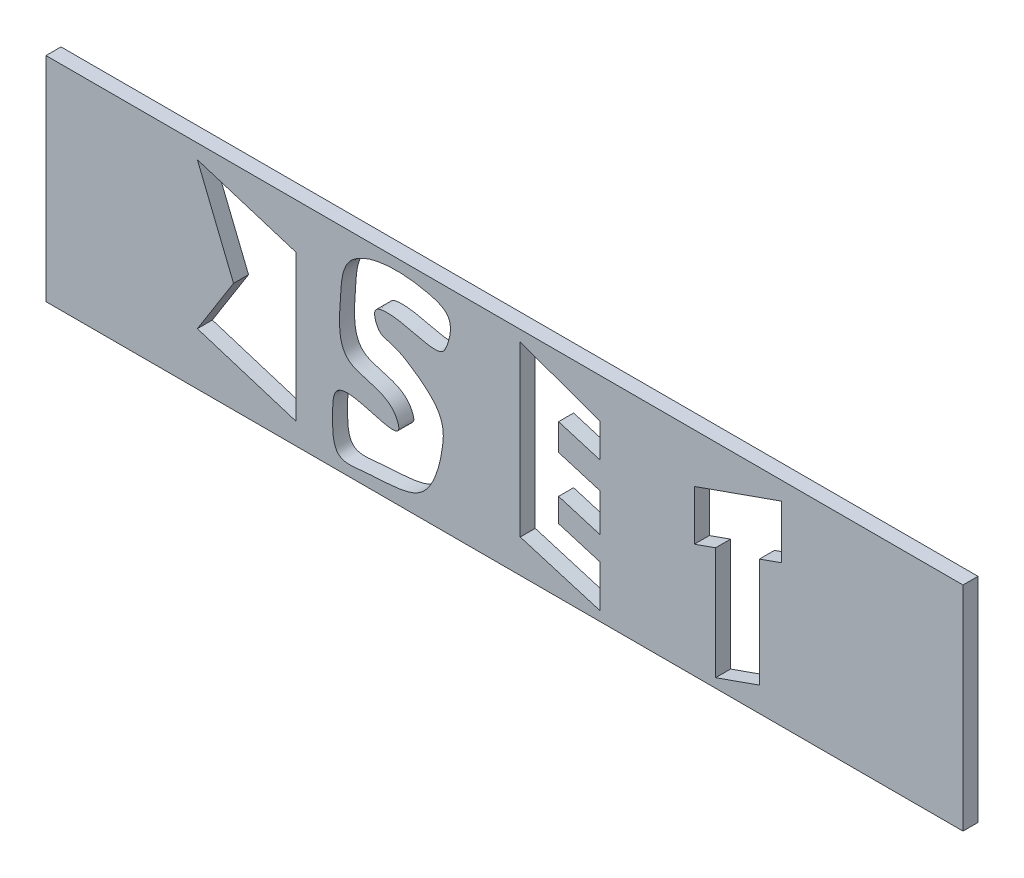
ISO-10303-21;
HEADER;
FILE_DESCRIPTION(('STEP AP214'),'2;1');
FILE_NAME('part.step','',(''),(''),'','','');
FILE_SCHEMA(('AUTOMOTIVE_DESIGN { 1 0 10303 214 1 1 1 1 }'));
ENDSEC;
DATA;
#1=APPLICATION_CONTEXT('core data for automotive mechanical design processes');
#2=APPLICATION_PROTOCOL_DEFINITION('international standard','automotive_design',2000,#1);
#3=PRODUCT_CONTEXT('',#1,'mechanical');
#4=PRODUCT('Part','Part','',(#3));
#5=PRODUCT_RELATED_PRODUCT_CATEGORY('part','',(#4));
#6=PRODUCT_DEFINITION_FORMATION('','',#4);
#7=PRODUCT_DEFINITION_CONTEXT('part definition',#1,'design');
#8=PRODUCT_DEFINITION('design','',#6,#7);
#9=PRODUCT_DEFINITION_SHAPE('','',#8);
#10=(LENGTH_UNIT() NAMED_UNIT(*) SI_UNIT(.MILLI.,.METRE.));
#11=(NAMED_UNIT(*) PLANE_ANGLE_UNIT() SI_UNIT($,.RADIAN.));
#12=(NAMED_UNIT(*) SI_UNIT($,.STERADIAN.) SOLID_ANGLE_UNIT());
#13=UNCERTAINTY_MEASURE_WITH_UNIT(LENGTH_MEASURE(1.E-05),#10,'distance_accuracy_value','');
#14=(GEOMETRIC_REPRESENTATION_CONTEXT(3) GLOBAL_UNCERTAINTY_ASSIGNED_CONTEXT((#13)) GLOBAL_UNIT_ASSIGNED_CONTEXT((#10,
#11,#12)) REPRESENTATION_CONTEXT('',''));
#15=CARTESIAN_POINT('',(0.,0.,0.));
#16=DIRECTION('',(0.,0.,1.));
#17=DIRECTION('',(1.,0.,0.));
#18=AXIS2_PLACEMENT_3D('',#15,#16,#17);
#19=CARTESIAN_POINT('',(0.,139.,9.));
#20=DIRECTION('',(0.,0.,-1.));
#21=DIRECTION('',(-1.,0.,0.));
#22=AXIS2_PLACEMENT_3D('',#19,#20,#21);
#23=PLANE('',#22);
#24=DIRECTION('',(0.,-1.,0.));
#25=VECTOR('',#24,1.);
#26=CARTESIAN_POINT('',(410.474193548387,71.5,9.));
#27=LINE('',#26,#25);
#28=CARTESIAN_POINT('',(410.474193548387,101.5,9.));
#29=VERTEX_POINT('',#28);
#30=CARTESIAN_POINT('',(410.474193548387,71.5,9.));
#31=VERTEX_POINT('',#30);
#32=EDGE_CURVE('E254',#29,#31,#27,.T.);
#33=ORIENTED_EDGE('',*,*,#32,.F.);
#34=DIRECTION('',(-0.942791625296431,-0.333382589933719,0.));
#35=VECTOR('',#34,1.);
#36=CARTESIAN_POINT('',(410.474193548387,101.5,9.));
#37=LINE('',#36,#35);
#38=CARTESIAN_POINT('',(462.791397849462,120.,9.));
#39=VERTEX_POINT('',#38);
#40=EDGE_CURVE('E270',#39,#29,#37,.T.);
#41=ORIENTED_EDGE('',*,*,#40,.F.);
#42=DIRECTION('',(0.,1.,0.));
#43=VECTOR('',#42,1.);
#44=CARTESIAN_POINT('',(462.791397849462,120.,9.));
#45=LINE('',#44,#43);
#46=CARTESIAN_POINT('',(462.791397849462,88.,9.));
#47=VERTEX_POINT('',#46);
#48=EDGE_CURVE('E267',#47,#39,#45,.T.);
#49=ORIENTED_EDGE('',*,*,#48,.F.);
#50=DIRECTION('',(0.942791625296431,0.333382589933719,0.));
#51=VECTOR('',#50,1.);
#52=CARTESIAN_POINT('',(462.791397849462,88.,9.));
#53=LINE('',#52,#51);
#54=CARTESIAN_POINT('',(449.5,83.3,9.));
#55=VERTEX_POINT('',#54);
#56=EDGE_CURVE('E265',#55,#47,#53,.T.);
#57=ORIENTED_EDGE('',*,*,#56,.F.);
#58=DIRECTION('',(0.,1.,0.));
#59=VECTOR('',#58,1.);
#60=CARTESIAN_POINT('',(449.5,83.3,9.));
#61=LINE('',#60,#59);
#62=CARTESIAN_POINT('',(449.5,17.8,9.));
#63=VERTEX_POINT('',#62);
#64=EDGE_CURVE('E263',#63,#55,#61,.T.);
#65=ORIENTED_EDGE('',*,*,#64,.F.);
#66=DIRECTION('',(0.942791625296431,0.333382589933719,0.));
#67=VECTOR('',#66,1.);
#68=CARTESIAN_POINT('',(449.5,17.8,9.));
#69=LINE('',#68,#67);
#70=CARTESIAN_POINT('',(423.2,8.5,9.));
#71=VERTEX_POINT('',#70);
#72=EDGE_CURVE('E261',#71,#63,#69,.T.);
#73=ORIENTED_EDGE('',*,*,#72,.F.);
#74=DIRECTION('',(0.,-1.,0.));
#75=VECTOR('',#74,1.);
#76=CARTESIAN_POINT('',(423.2,8.5,9.));
#77=LINE('',#76,#75);
#78=CARTESIAN_POINT('',(423.2,76.,9.));
#79=VERTEX_POINT('',#78);
#80=EDGE_CURVE('E259',#79,#71,#77,.T.);
#81=ORIENTED_EDGE('',*,*,#80,.F.);
#82=DIRECTION('',(0.942791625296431,0.33338258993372,0.));
#83=VECTOR('',#82,1.);
#84=CARTESIAN_POINT('',(423.2,76.,9.));
#85=LINE('',#84,#83);
#86=EDGE_CURVE('E256',#31,#79,#85,.T.);
#87=ORIENTED_EDGE('',*,*,#86,.F.);
#88=EDGE_LOOP('',(#33,#41,#49,#57,#65,#73,#81,#87));
#89=FACE_BOUND('',#88,.T.);
#90=CARTESIAN_POINT('',(250.451103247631,122.077203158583,9.));
#91=CARTESIAN_POINT('',(234.576066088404,125.766642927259,9.));
#92=CARTESIAN_POINT('',(209.832006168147,124.794224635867,9.));
#93=CARTESIAN_POINT('',(199.387770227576,110.754500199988,9.));
#94=CARTESIAN_POINT('',(197.001096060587,79.0117337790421,9.));
#95=CARTESIAN_POINT('',(195.444091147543,57.8599975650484,9.));
#96=CARTESIAN_POINT('',(227.725173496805,58.0916978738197,9.));
#97=CARTESIAN_POINT('',(238.712849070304,31.2573986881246,9.));
#98=CARTESIAN_POINT('',(193.842474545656,56.9884962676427,9.));
#99=CARTESIAN_POINT('',(193.249701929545,28.3580537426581,9.));
#100=CARTESIAN_POINT('',(193.414417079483,7.1790298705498,9.));
#101=CARTESIAN_POINT('',(221.156842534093,11.8813476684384,9.));
#102=CARTESIAN_POINT('',(250.675590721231,9.48355704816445,9.));
#103=CARTESIAN_POINT('',(262.105561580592,52.0392195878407,9.));
#104=CARTESIAN_POINT('',(259.8493853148,66.2444237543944,9.));
#105=CARTESIAN_POINT('',(227.651976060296,87.0164130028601,9.));
#106=CARTESIAN_POINT('',(221.79163942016,82.3551512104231,9.));
#107=CARTESIAN_POINT('',(217.05063217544,98.6346712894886,9.));
#108=CARTESIAN_POINT('',(236.826109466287,101.780458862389,9.));
#109=CARTESIAN_POINT('',(257.137510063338,89.9517733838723,9.));
#110=CARTESIAN_POINT('',(262.907018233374,102.013136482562,9.));
#111=CARTESIAN_POINT('',(267.671859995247,116.919735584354,9.));
#112=CARTESIAN_POINT('',(255.998863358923,120.787875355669,9.));
#113=CARTESIAN_POINT('',(250.451103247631,122.077203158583,9.));
#114=B_SPLINE_CURVE_WITH_KNOTS('',3,(#90,#91,#92,#93,#94,#95,#96,#97,#98,#99,#100,#101,#102,
#103,#104,#105,#106,#107,#108,#109,#110,#111,#112,#113),.UNSPECIFIED.,.T.,.F.,(4,1,2,1,1,1,1,1,
1,1,1,1,2,1,1,1,2,1,4),(0.,0.098400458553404,0.148759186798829,0.237266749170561,
0.301598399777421,0.317591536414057,0.401494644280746,0.435731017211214,0.482086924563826,
0.518804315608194,0.59904669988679,0.669356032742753,0.762623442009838,0.810518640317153,
0.828887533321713,0.845072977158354,0.92685254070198,0.965612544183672,1.),.UNSPECIFIED.);
#115=CARTESIAN_POINT('',(250.451103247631,122.077203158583,9.));
#116=VERTEX_POINT('',#115);
#117=EDGE_CURVE('E400',#116,#116,#114,.T.);
#118=ORIENTED_EDGE('',*,*,#117,.F.);
#119=EDGE_LOOP('',(#118));
#120=FACE_BOUND('',#119,.T.);
#121=DIRECTION('',(0.376679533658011,-0.9263436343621,0.));
#122=VECTOR('',#121,1.);
#123=CARTESIAN_POINT('',(134.,68.79,9.));
#124=LINE('',#123,#122);
#125=CARTESIAN_POINT('',(112.29,122.18,9.));
#126=VERTEX_POINT('',#125);
#127=CARTESIAN_POINT('',(134.,68.79,9.));
#128=VERTEX_POINT('',#127);
#129=EDGE_CURVE('E456',#126,#128,#124,.T.);
#130=ORIENTED_EDGE('',*,*,#129,.F.);
#131=DIRECTION('',(-0.954394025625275,0.298549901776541,0.));
#132=VECTOR('',#131,1.);
#133=CARTESIAN_POINT('',(112.29,122.18,9.));
#134=LINE('',#133,#132);
#135=CARTESIAN_POINT('',(171.59,103.63,9.));
#136=VERTEX_POINT('',#135);
#137=EDGE_CURVE('E787',#136,#126,#134,.T.);
#138=ORIENTED_EDGE('',*,*,#137,.F.);
#139=DIRECTION('',(0.,1.,0.));
#140=VECTOR('',#139,1.);
#141=CARTESIAN_POINT('',(171.59,103.63,9.));
#142=LINE('',#141,#140);
#143=CARTESIAN_POINT('',(171.59,15.82,9.));
#144=VERTEX_POINT('',#143);
#145=EDGE_CURVE('E803',#144,#136,#142,.T.);
#146=ORIENTED_EDGE('',*,*,#145,.F.);
#147=DIRECTION('',(0.954348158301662,-0.298696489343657,0.));
#148=VECTOR('',#147,1.);
#149=CARTESIAN_POINT('',(171.59,15.82,9.));
#150=LINE('',#149,#148);
#151=CARTESIAN_POINT('',(112.29,34.38,9.));
#152=VERTEX_POINT('',#151);
#153=EDGE_CURVE('E806',#152,#144,#150,.T.);
#154=ORIENTED_EDGE('',*,*,#153,.F.);
#155=DIRECTION('',(-0.533595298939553,-0.845739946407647,0.));
#156=VECTOR('',#155,1.);
#157=CARTESIAN_POINT('',(112.29,34.38,9.));
#158=LINE('',#157,#156);
#159=EDGE_CURVE('E808',#128,#152,#158,.T.);
#160=ORIENTED_EDGE('',*,*,#159,.F.);
#161=EDGE_LOOP('',(#130,#138,#146,#154,#160));
#162=FACE_BOUND('',#161,.T.);
#163=DIRECTION('',(0.,1.,0.));
#164=VECTOR('',#163,1.);
#165=CARTESIAN_POINT('',(354.,86.92,9.));
#166=LINE('',#165,#164);
#167=CARTESIAN_POINT('',(354.,86.92,9.));
#168=VERTEX_POINT('',#167);
#169=CARTESIAN_POINT('',(354.,106.92,9.));
#170=VERTEX_POINT('',#169);
#171=EDGE_CURVE('E313',#168,#170,#166,.T.);
#172=ORIENTED_EDGE('',*,*,#171,.F.);
#173=DIRECTION('',(0.957826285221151,-0.287347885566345,0.));
#174=VECTOR('',#173,1.);
#175=CARTESIAN_POINT('',(329.,94.42,9.));
#176=LINE('',#175,#174);
#177=CARTESIAN_POINT('',(329.,94.42,9.));
#178=VERTEX_POINT('',#177);
#179=EDGE_CURVE('E337',#178,#168,#176,.T.);
#180=ORIENTED_EDGE('',*,*,#179,.F.);
#181=DIRECTION('',(0.,1.,0.));
#182=VECTOR('',#181,1.);
#183=CARTESIAN_POINT('',(329.,78.42,9.));
#184=LINE('',#183,#182);
#185=CARTESIAN_POINT('',(329.,78.42,9.));
#186=VERTEX_POINT('',#185);
#187=EDGE_CURVE('E334',#186,#178,#184,.T.);
#188=ORIENTED_EDGE('',*,*,#187,.F.);
#189=DIRECTION('',(-0.957826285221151,0.287347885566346,0.));
#190=VECTOR('',#189,1.);
#191=CARTESIAN_POINT('',(354.,70.92,9.));
#192=LINE('',#191,#190);
#193=CARTESIAN_POINT('',(354.,70.92,9.));
#194=VERTEX_POINT('',#193);
#195=EDGE_CURVE('E332',#194,#186,#192,.T.);
#196=ORIENTED_EDGE('',*,*,#195,.F.);
#197=DIRECTION('',(0.,1.,0.));
#198=VECTOR('',#197,1.);
#199=CARTESIAN_POINT('',(354.,48.12,9.));
#200=LINE('',#199,#198);
#201=CARTESIAN_POINT('',(354.,48.12,9.));
#202=VERTEX_POINT('',#201);
#203=EDGE_CURVE('E330',#202,#194,#200,.T.);
#204=ORIENTED_EDGE('',*,*,#203,.F.);
#205=DIRECTION('',(0.957826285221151,-0.287347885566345,0.));
#206=VECTOR('',#205,1.);
#207=CARTESIAN_POINT('',(329.,55.62,9.));
#208=LINE('',#207,#206);
#209=CARTESIAN_POINT('',(329.,55.62,9.));
#210=VERTEX_POINT('',#209);
#211=EDGE_CURVE('E328',#210,#202,#208,.T.);
#212=ORIENTED_EDGE('',*,*,#211,.F.);
#213=DIRECTION('',(0.,1.,0.));
#214=VECTOR('',#213,1.);
#215=CARTESIAN_POINT('',(329.,41.42,9.));
#216=LINE('',#215,#214);
#217=CARTESIAN_POINT('',(329.,41.42,9.));
#218=VERTEX_POINT('',#217);
#219=EDGE_CURVE('E326',#218,#210,#216,.T.);
#220=ORIENTED_EDGE('',*,*,#219,.F.);
#221=DIRECTION('',(-0.957826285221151,0.287347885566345,0.));
#222=VECTOR('',#221,1.);
#223=CARTESIAN_POINT('',(354.,33.92,9.));
#224=LINE('',#223,#222);
#225=CARTESIAN_POINT('',(354.,33.92,9.));
#226=VERTEX_POINT('',#225);
#227=EDGE_CURVE('E324',#226,#218,#224,.T.);
#228=ORIENTED_EDGE('',*,*,#227,.F.);
#229=DIRECTION('',(0.,1.,0.));
#230=VECTOR('',#229,1.);
#231=CARTESIAN_POINT('',(354.,8.6,9.));
#232=LINE('',#231,#230);
#233=CARTESIAN_POINT('',(354.,8.6,9.));
#234=VERTEX_POINT('',#233);
#235=EDGE_CURVE('E322',#234,#226,#232,.T.);
#236=ORIENTED_EDGE('',*,*,#235,.F.);
#237=DIRECTION('',(0.957826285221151,-0.287347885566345,0.));
#238=VECTOR('',#237,1.);
#239=CARTESIAN_POINT('',(306.,23.,9.));
#240=LINE('',#239,#238);
#241=CARTESIAN_POINT('',(306.,23.,9.));
#242=VERTEX_POINT('',#241);
#243=EDGE_CURVE('E320',#242,#234,#240,.T.);
#244=ORIENTED_EDGE('',*,*,#243,.F.);
#245=DIRECTION('',(0.,-1.,0.));
#246=VECTOR('',#245,1.);
#247=CARTESIAN_POINT('',(306.,124.42,9.));
#248=LINE('',#247,#246);
#249=CARTESIAN_POINT('',(306.,124.42,9.));
#250=VERTEX_POINT('',#249);
#251=EDGE_CURVE('E318',#250,#242,#248,.T.);
#252=ORIENTED_EDGE('',*,*,#251,.F.);
#253=DIRECTION('',(-0.939507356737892,0.34252872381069,0.));
#254=VECTOR('',#253,1.);
#255=CARTESIAN_POINT('',(354.,106.92,9.));
#256=LINE('',#255,#254);
#257=EDGE_CURVE('E315',#170,#250,#256,.T.);
#258=ORIENTED_EDGE('',*,*,#257,.F.);
#259=EDGE_LOOP('',(#172,#180,#188,#196,#204,#212,#220,#228,#236,#244,#252,#258));
#260=FACE_BOUND('',#259,.T.);
#261=DIRECTION('',(0.,-1.,0.));
#262=VECTOR('',#261,1.);
#263=CARTESIAN_POINT('',(21.4877992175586,130.892473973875,9.));
#264=LINE('',#263,#262);
#265=CARTESIAN_POINT('',(21.4877992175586,130.892473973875,9.));
#266=VERTEX_POINT('',#265);
#267=CARTESIAN_POINT('',(21.4877992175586,2.99247397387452,9.));
#268=VERTEX_POINT('',#267);
#269=EDGE_CURVE('E246',#266,#268,#264,.T.);
#270=ORIENTED_EDGE('',*,*,#269,.T.);
#271=DIRECTION('',(1.,0.,0.));
#272=VECTOR('',#271,1.);
#273=CARTESIAN_POINT('',(21.4877992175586,2.99247397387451,9.));
#274=LINE('',#273,#272);
#275=CARTESIAN_POINT('',(571.627799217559,2.9924739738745,9.));
#276=VERTEX_POINT('',#275);
#277=EDGE_CURVE('E244',#268,#276,#274,.T.);
#278=ORIENTED_EDGE('',*,*,#277,.T.);
#279=DIRECTION('',(0.,1.,0.));
#280=VECTOR('',#279,1.);
#281=CARTESIAN_POINT('',(571.627799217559,130.892473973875,9.));
#282=LINE('',#281,#280);
#283=CARTESIAN_POINT('',(571.627799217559,130.892473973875,9.));
#284=VERTEX_POINT('',#283);
#285=EDGE_CURVE('E50',#276,#284,#282,.T.);
#286=ORIENTED_EDGE('',*,*,#285,.T.);
#287=DIRECTION('',(-1.,0.,0.));
#288=VECTOR('',#287,1.);
#289=CARTESIAN_POINT('',(21.4877992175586,130.892473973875,9.));
#290=LINE('',#289,#288);
#291=EDGE_CURVE('E236',#284,#266,#290,.T.);
#292=ORIENTED_EDGE('',*,*,#291,.T.);
#293=EDGE_LOOP('',(#270,#278,#286,#292));
#294=FACE_BOUND('',#293,.T.);
#295=ADVANCED_FACE('F35',(#89,#120,#162,#260,#294),#23,.F.);
#296=CARTESIAN_POINT('',(0.,139.,0.));
#297=DIRECTION('',(0.,0.,-1.));
#298=DIRECTION('',(-1.,0.,0.));
#299=AXIS2_PLACEMENT_3D('',#296,#297,#298);
#300=PLANE('',#299);
#301=DIRECTION('',(-0.942791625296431,-0.333382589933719,0.));
#302=VECTOR('',#301,1.);
#303=CARTESIAN_POINT('',(410.474193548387,101.5,0.));
#304=LINE('',#303,#302);
#305=CARTESIAN_POINT('',(462.791397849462,120.,0.));
#306=VERTEX_POINT('',#305);
#307=CARTESIAN_POINT('',(410.474193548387,101.5,0.));
#308=VERTEX_POINT('',#307);
#309=EDGE_CURVE('E257',#306,#308,#304,.T.);
#310=ORIENTED_EDGE('',*,*,#309,.T.);
#311=DIRECTION('',(0.,-1.,0.));
#312=VECTOR('',#311,1.);
#313=CARTESIAN_POINT('',(410.474193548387,71.5,0.));
#314=LINE('',#313,#312);
#315=CARTESIAN_POINT('',(410.474193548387,71.5,0.));
#316=VERTEX_POINT('',#315);
#317=EDGE_CURVE('E250',#308,#316,#314,.T.);
#318=ORIENTED_EDGE('',*,*,#317,.T.);
#319=DIRECTION('',(0.942791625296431,0.33338258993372,0.));
#320=VECTOR('',#319,1.);
#321=CARTESIAN_POINT('',(423.2,76.,0.));
#322=LINE('',#321,#320);
#323=CARTESIAN_POINT('',(423.2,76.,0.));
#324=VERTEX_POINT('',#323);
#325=EDGE_CURVE('E275',#316,#324,#322,.T.);
#326=ORIENTED_EDGE('',*,*,#325,.T.);
#327=DIRECTION('',(0.,-1.,0.));
#328=VECTOR('',#327,1.);
#329=CARTESIAN_POINT('',(423.2,8.5,0.));
#330=LINE('',#329,#328);
#331=CARTESIAN_POINT('',(423.2,8.5,0.));
#332=VERTEX_POINT('',#331);
#333=EDGE_CURVE('E278',#324,#332,#330,.T.);
#334=ORIENTED_EDGE('',*,*,#333,.T.);
#335=DIRECTION('',(0.942791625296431,0.333382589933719,0.));
#336=VECTOR('',#335,1.);
#337=CARTESIAN_POINT('',(449.5,17.8,0.));
#338=LINE('',#337,#336);
#339=CARTESIAN_POINT('',(449.5,17.8,0.));
#340=VERTEX_POINT('',#339);
#341=EDGE_CURVE('E281',#332,#340,#338,.T.);
#342=ORIENTED_EDGE('',*,*,#341,.T.);
#343=DIRECTION('',(0.,1.,0.));
#344=VECTOR('',#343,1.);
#345=CARTESIAN_POINT('',(449.5,83.3,0.));
#346=LINE('',#345,#344);
#347=CARTESIAN_POINT('',(449.5,83.3,0.));
#348=VERTEX_POINT('',#347);
#349=EDGE_CURVE('E284',#340,#348,#346,.T.);
#350=ORIENTED_EDGE('',*,*,#349,.T.);
#351=DIRECTION('',(0.942791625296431,0.333382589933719,0.));
#352=VECTOR('',#351,1.);
#353=CARTESIAN_POINT('',(462.791397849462,88.,0.));
#354=LINE('',#353,#352);
#355=CARTESIAN_POINT('',(462.791397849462,88.,0.));
#356=VERTEX_POINT('',#355);
#357=EDGE_CURVE('E287',#348,#356,#354,.T.);
#358=ORIENTED_EDGE('',*,*,#357,.T.);
#359=DIRECTION('',(0.,1.,0.));
#360=VECTOR('',#359,1.);
#361=CARTESIAN_POINT('',(462.791397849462,120.,0.));
#362=LINE('',#361,#360);
#363=EDGE_CURVE('E290',#356,#306,#362,.T.);
#364=ORIENTED_EDGE('',*,*,#363,.T.);
#365=EDGE_LOOP('',(#310,#318,#326,#334,#342,#350,#358,#364));
#366=FACE_BOUND('',#365,.T.);
#367=CARTESIAN_POINT('',(250.451103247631,122.077203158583,0.));
#368=CARTESIAN_POINT('',(234.576066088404,125.766642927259,0.));
#369=CARTESIAN_POINT('',(209.832006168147,124.794224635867,0.));
#370=CARTESIAN_POINT('',(199.387770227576,110.754500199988,0.));
#371=CARTESIAN_POINT('',(197.001096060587,79.0117337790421,0.));
#372=CARTESIAN_POINT('',(195.444091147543,57.8599975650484,0.));
#373=CARTESIAN_POINT('',(227.725173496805,58.0916978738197,0.));
#374=CARTESIAN_POINT('',(238.712849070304,31.2573986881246,0.));
#375=CARTESIAN_POINT('',(193.842474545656,56.9884962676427,0.));
#376=CARTESIAN_POINT('',(193.249701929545,28.3580537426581,0.));
#377=CARTESIAN_POINT('',(193.414417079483,7.1790298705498,0.));
#378=CARTESIAN_POINT('',(221.156842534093,11.8813476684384,0.));
#379=CARTESIAN_POINT('',(250.675590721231,9.48355704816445,0.));
#380=CARTESIAN_POINT('',(262.105561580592,52.0392195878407,0.));
#381=CARTESIAN_POINT('',(259.8493853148,66.2444237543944,0.));
#382=CARTESIAN_POINT('',(227.651976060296,87.0164130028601,0.));
#383=CARTESIAN_POINT('',(221.79163942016,82.3551512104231,0.));
#384=CARTESIAN_POINT('',(217.05063217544,98.6346712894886,0.));
#385=CARTESIAN_POINT('',(236.826109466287,101.780458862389,0.));
#386=CARTESIAN_POINT('',(257.137510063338,89.9517733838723,0.));
#387=CARTESIAN_POINT('',(262.907018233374,102.013136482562,0.));
#388=CARTESIAN_POINT('',(267.671859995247,116.919735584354,0.));
#389=CARTESIAN_POINT('',(255.998863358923,120.787875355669,0.));
#390=CARTESIAN_POINT('',(250.451103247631,122.077203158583,0.));
#391=B_SPLINE_CURVE_WITH_KNOTS('',3,(#367,#368,#369,#370,#371,#372,#373,#374,#375,#376,#377,
#378,#379,#380,#381,#382,#383,#384,#385,#386,#387,#388,#389,#390),.UNSPECIFIED.,.T.,.F.,(4,1,2,
1,1,1,1,1,1,1,1,1,2,1,1,1,2,1,4),(0.,0.098400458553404,0.148759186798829,0.237266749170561,
0.301598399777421,0.317591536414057,0.401494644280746,0.435731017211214,0.482086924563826,
0.518804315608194,0.59904669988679,0.669356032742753,0.762623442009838,0.810518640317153,
0.828887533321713,0.845072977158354,0.92685254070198,0.965612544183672,1.),.UNSPECIFIED.);
#392=CARTESIAN_POINT('',(250.451103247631,122.077203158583,0.));
#393=VERTEX_POINT('',#392);
#394=EDGE_CURVE('E399',#393,#393,#391,.T.);
#395=ORIENTED_EDGE('',*,*,#394,.T.);
#396=EDGE_LOOP('',(#395));
#397=FACE_BOUND('',#396,.T.);
#398=DIRECTION('',(-0.954394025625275,0.298549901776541,0.));
#399=VECTOR('',#398,1.);
#400=CARTESIAN_POINT('',(112.29,122.18,0.));
#401=LINE('',#400,#399);
#402=CARTESIAN_POINT('',(171.59,103.63,0.));
#403=VERTEX_POINT('',#402);
#404=CARTESIAN_POINT('',(112.29,122.18,0.));
#405=VERTEX_POINT('',#404);
#406=EDGE_CURVE('E788',#403,#405,#401,.T.);
#407=ORIENTED_EDGE('',*,*,#406,.T.);
#408=DIRECTION('',(0.376679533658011,-0.9263436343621,0.));
#409=VECTOR('',#408,1.);
#410=CARTESIAN_POINT('',(134.,68.79,0.));
#411=LINE('',#410,#409);
#412=CARTESIAN_POINT('',(134.,68.79,0.));
#413=VERTEX_POINT('',#412);
#414=EDGE_CURVE('E406',#405,#413,#411,.T.);
#415=ORIENTED_EDGE('',*,*,#414,.T.);
#416=DIRECTION('',(-0.533595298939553,-0.845739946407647,0.));
#417=VECTOR('',#416,1.);
#418=CARTESIAN_POINT('',(112.29,34.38,0.));
#419=LINE('',#418,#417);
#420=CARTESIAN_POINT('',(112.29,34.38,0.));
#421=VERTEX_POINT('',#420);
#422=EDGE_CURVE('E797',#413,#421,#419,.T.);
#423=ORIENTED_EDGE('',*,*,#422,.T.);
#424=DIRECTION('',(0.954348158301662,-0.298696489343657,0.));
#425=VECTOR('',#424,1.);
#426=CARTESIAN_POINT('',(171.59,15.82,0.));
#427=LINE('',#426,#425);
#428=CARTESIAN_POINT('',(171.59,15.82,0.));
#429=VERTEX_POINT('',#428);
#430=EDGE_CURVE('E794',#421,#429,#427,.T.);
#431=ORIENTED_EDGE('',*,*,#430,.T.);
#432=DIRECTION('',(0.,1.,0.));
#433=VECTOR('',#432,1.);
#434=CARTESIAN_POINT('',(171.59,103.63,0.));
#435=LINE('',#434,#433);
#436=EDGE_CURVE('E791',#429,#403,#435,.T.);
#437=ORIENTED_EDGE('',*,*,#436,.T.);
#438=EDGE_LOOP('',(#407,#415,#423,#431,#437));
#439=FACE_BOUND('',#438,.T.);
#440=DIRECTION('',(0.957826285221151,-0.287347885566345,0.));
#441=VECTOR('',#440,1.);
#442=CARTESIAN_POINT('',(329.,94.42,0.));
#443=LINE('',#442,#441);
#444=CARTESIAN_POINT('',(329.,94.42,0.));
#445=VERTEX_POINT('',#444);
#446=CARTESIAN_POINT('',(354.,86.92,0.));
#447=VERTEX_POINT('',#446);
#448=EDGE_CURVE('E316',#445,#447,#443,.T.);
#449=ORIENTED_EDGE('',*,*,#448,.T.);
#450=DIRECTION('',(0.,1.,0.));
#451=VECTOR('',#450,1.);
#452=CARTESIAN_POINT('',(354.,86.92,0.));
#453=LINE('',#452,#451);
#454=CARTESIAN_POINT('',(354.,106.92,0.));
#455=VERTEX_POINT('',#454);
#456=EDGE_CURVE('E312',#447,#455,#453,.T.);
#457=ORIENTED_EDGE('',*,*,#456,.T.);
#458=DIRECTION('',(-0.939507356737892,0.34252872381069,0.));
#459=VECTOR('',#458,1.);
#460=CARTESIAN_POINT('',(354.,106.92,0.));
#461=LINE('',#460,#459);
#462=CARTESIAN_POINT('',(306.,124.42,0.));
#463=VERTEX_POINT('',#462);
#464=EDGE_CURVE('E342',#455,#463,#461,.T.);
#465=ORIENTED_EDGE('',*,*,#464,.T.);
#466=DIRECTION('',(0.,-1.,0.));
#467=VECTOR('',#466,1.);
#468=CARTESIAN_POINT('',(306.,124.42,0.));
#469=LINE('',#468,#467);
#470=CARTESIAN_POINT('',(306.,23.,0.));
#471=VERTEX_POINT('',#470);
#472=EDGE_CURVE('E345',#463,#471,#469,.T.);
#473=ORIENTED_EDGE('',*,*,#472,.T.);
#474=DIRECTION('',(0.957826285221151,-0.287347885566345,0.));
#475=VECTOR('',#474,1.);
#476=CARTESIAN_POINT('',(306.,23.,0.));
#477=LINE('',#476,#475);
#478=CARTESIAN_POINT('',(354.,8.6,0.));
#479=VERTEX_POINT('',#478);
#480=EDGE_CURVE('E348',#471,#479,#477,.T.);
#481=ORIENTED_EDGE('',*,*,#480,.T.);
#482=DIRECTION('',(0.,1.,0.));
#483=VECTOR('',#482,1.);
#484=CARTESIAN_POINT('',(354.,8.6,0.));
#485=LINE('',#484,#483);
#486=CARTESIAN_POINT('',(354.,33.92,0.));
#487=VERTEX_POINT('',#486);
#488=EDGE_CURVE('E351',#479,#487,#485,.T.);
#489=ORIENTED_EDGE('',*,*,#488,.T.);
#490=DIRECTION('',(-0.957826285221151,0.287347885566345,0.));
#491=VECTOR('',#490,1.);
#492=CARTESIAN_POINT('',(354.,33.92,0.));
#493=LINE('',#492,#491);
#494=CARTESIAN_POINT('',(329.,41.42,0.));
#495=VERTEX_POINT('',#494);
#496=EDGE_CURVE('E354',#487,#495,#493,.T.);
#497=ORIENTED_EDGE('',*,*,#496,.T.);
#498=DIRECTION('',(0.,1.,0.));
#499=VECTOR('',#498,1.);
#500=CARTESIAN_POINT('',(329.,41.42,0.));
#501=LINE('',#500,#499);
#502=CARTESIAN_POINT('',(329.,55.62,0.));
#503=VERTEX_POINT('',#502);
#504=EDGE_CURVE('E357',#495,#503,#501,.T.);
#505=ORIENTED_EDGE('',*,*,#504,.T.);
#506=DIRECTION('',(0.957826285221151,-0.287347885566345,0.));
#507=VECTOR('',#506,1.);
#508=CARTESIAN_POINT('',(329.,55.62,0.));
#509=LINE('',#508,#507);
#510=CARTESIAN_POINT('',(354.,48.12,0.));
#511=VERTEX_POINT('',#510);
#512=EDGE_CURVE('E360',#503,#511,#509,.T.);
#513=ORIENTED_EDGE('',*,*,#512,.T.);
#514=DIRECTION('',(0.,1.,0.));
#515=VECTOR('',#514,1.);
#516=CARTESIAN_POINT('',(354.,48.12,0.));
#517=LINE('',#516,#515);
#518=CARTESIAN_POINT('',(354.,70.92,0.));
#519=VERTEX_POINT('',#518);
#520=EDGE_CURVE('E363',#511,#519,#517,.T.);
#521=ORIENTED_EDGE('',*,*,#520,.T.);
#522=DIRECTION('',(-0.957826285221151,0.287347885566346,0.));
#523=VECTOR('',#522,1.);
#524=CARTESIAN_POINT('',(354.,70.92,0.));
#525=LINE('',#524,#523);
#526=CARTESIAN_POINT('',(329.,78.42,0.));
#527=VERTEX_POINT('',#526);
#528=EDGE_CURVE('E366',#519,#527,#525,.T.);
#529=ORIENTED_EDGE('',*,*,#528,.T.);
#530=DIRECTION('',(0.,1.,0.));
#531=VECTOR('',#530,1.);
#532=CARTESIAN_POINT('',(329.,78.42,0.));
#533=LINE('',#532,#531);
#534=EDGE_CURVE('E369',#527,#445,#533,.T.);
#535=ORIENTED_EDGE('',*,*,#534,.T.);
#536=EDGE_LOOP('',(#449,#457,#465,#473,#481,#489,#497,#505,#513,#521,#529,#535));
#537=FACE_BOUND('',#536,.T.);
#538=DIRECTION('',(-1.,0.,0.));
#539=VECTOR('',#538,1.);
#540=CARTESIAN_POINT('',(0.,2.9924739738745,0.));
#541=LINE('',#540,#539);
#542=CARTESIAN_POINT('',(571.627799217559,2.99247397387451,0.));
#543=VERTEX_POINT('',#542);
#544=CARTESIAN_POINT('',(21.4877992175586,2.9924739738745,0.));
#545=VERTEX_POINT('',#544);
#546=EDGE_CURVE('E771',#543,#545,#541,.T.);
#547=ORIENTED_EDGE('',*,*,#546,.T.);
#548=DIRECTION('',(0.,1.,0.));
#549=VECTOR('',#548,1.);
#550=CARTESIAN_POINT('',(21.4877992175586,139.,0.));
#551=LINE('',#550,#549);
#552=CARTESIAN_POINT('',(21.4877992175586,130.892473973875,0.));
#553=VERTEX_POINT('',#552);
#554=EDGE_CURVE('E12',#545,#553,#551,.T.);
#555=ORIENTED_EDGE('',*,*,#554,.T.);
#556=DIRECTION('',(1.,0.,0.));
#557=VECTOR('',#556,1.);
#558=CARTESIAN_POINT('',(0.,130.892473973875,0.));
#559=LINE('',#558,#557);
#560=CARTESIAN_POINT('',(571.627799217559,130.892473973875,0.));
#561=VERTEX_POINT('',#560);
#562=EDGE_CURVE('E43',#553,#561,#559,.T.);
#563=ORIENTED_EDGE('',*,*,#562,.T.);
#564=DIRECTION('',(0.,-1.,0.));
#565=VECTOR('',#564,1.);
#566=CARTESIAN_POINT('',(571.627799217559,139.,0.));
#567=LINE('',#566,#565);
#568=EDGE_CURVE('E229',#561,#543,#567,.T.);
#569=ORIENTED_EDGE('',*,*,#568,.T.);
#570=EDGE_LOOP('',(#547,#555,#563,#569));
#571=FACE_BOUND('',#570,.T.);
#572=ADVANCED_FACE('F37',(#366,#397,#439,#537,#571),#300,.T.);
#573=CARTESIAN_POINT('',(134.,68.79,9.));
#574=DIRECTION('',(0.9263436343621,0.376679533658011,0.));
#575=DIRECTION('',(-0.376679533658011,0.9263436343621,0.));
#576=AXIS2_PLACEMENT_3D('',#573,#574,#575);
#577=PLANE('',#576);
#578=ORIENTED_EDGE('',*,*,#414,.F.);
#579=DIRECTION('',(0.,0.,-1.));
#580=VECTOR('',#579,1.);
#581=CARTESIAN_POINT('',(112.29,122.18,9.));
#582=LINE('',#581,#580);
#583=EDGE_CURVE('E784',#126,#405,#582,.T.);
#584=ORIENTED_EDGE('',*,*,#583,.F.);
#585=ORIENTED_EDGE('',*,*,#129,.T.);
#586=DIRECTION('',(0.,0.,-1.));
#587=VECTOR('',#586,1.);
#588=CARTESIAN_POINT('',(134.,68.79,9.));
#589=LINE('',#588,#587);
#590=EDGE_CURVE('E773',#128,#413,#589,.T.);
#591=ORIENTED_EDGE('',*,*,#590,.T.);
#592=EDGE_LOOP('',(#578,#584,#585,#591));
#593=FACE_BOUND('',#592,.T.);
#594=ADVANCED_FACE('F436',(#593),#577,.T.);
#595=CARTESIAN_POINT('',(112.29,34.38,9.));
#596=DIRECTION('',(0.845739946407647,-0.533595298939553,0.));
#597=DIRECTION('',(0.533595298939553,0.845739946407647,0.));
#598=AXIS2_PLACEMENT_3D('',#595,#596,#597);
#599=PLANE('',#598);
#600=ORIENTED_EDGE('',*,*,#422,.F.);
#601=ORIENTED_EDGE('',*,*,#590,.F.);
#602=ORIENTED_EDGE('',*,*,#159,.T.);
#603=DIRECTION('',(0.,0.,-1.));
#604=VECTOR('',#603,1.);
#605=CARTESIAN_POINT('',(112.29,34.38,9.));
#606=LINE('',#605,#604);
#607=EDGE_CURVE('E778',#152,#421,#606,.T.);
#608=ORIENTED_EDGE('',*,*,#607,.T.);
#609=EDGE_LOOP('',(#600,#601,#602,#608));
#610=FACE_BOUND('',#609,.T.);
#611=ADVANCED_FACE('F432',(#610),#599,.T.);
#612=CARTESIAN_POINT('',(171.59,15.82,9.));
#613=DIRECTION('',(0.298696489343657,0.954348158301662,0.));
#614=DIRECTION('',(-0.954348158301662,0.298696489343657,0.));
#615=AXIS2_PLACEMENT_3D('',#612,#613,#614);
#616=PLANE('',#615);
#617=ORIENTED_EDGE('',*,*,#430,.F.);
#618=ORIENTED_EDGE('',*,*,#607,.F.);
#619=ORIENTED_EDGE('',*,*,#153,.T.);
#620=DIRECTION('',(0.,0.,-1.));
#621=VECTOR('',#620,1.);
#622=CARTESIAN_POINT('',(171.59,15.82,9.));
#623=LINE('',#622,#621);
#624=EDGE_CURVE('E780',#144,#429,#623,.T.);
#625=ORIENTED_EDGE('',*,*,#624,.T.);
#626=EDGE_LOOP('',(#617,#618,#619,#625));
#627=FACE_BOUND('',#626,.T.);
#628=ADVANCED_FACE('F428',(#627),#616,.T.);
#629=CARTESIAN_POINT('',(171.59,103.63,9.));
#630=DIRECTION('',(-1.,0.,0.));
#631=DIRECTION('',(0.,0.,1.));
#632=AXIS2_PLACEMENT_3D('',#629,#630,#631);
#633=PLANE('',#632);
#634=ORIENTED_EDGE('',*,*,#436,.F.);
#635=ORIENTED_EDGE('',*,*,#624,.F.);
#636=ORIENTED_EDGE('',*,*,#145,.T.);
#637=DIRECTION('',(0.,0.,-1.));
#638=VECTOR('',#637,1.);
#639=CARTESIAN_POINT('',(171.59,103.63,9.));
#640=LINE('',#639,#638);
#641=EDGE_CURVE('E782',#136,#403,#640,.T.);
#642=ORIENTED_EDGE('',*,*,#641,.T.);
#643=EDGE_LOOP('',(#634,#635,#636,#642));
#644=FACE_BOUND('',#643,.T.);
#645=ADVANCED_FACE('F424',(#644),#633,.T.);
#646=CARTESIAN_POINT('',(112.29,122.18,9.));
#647=DIRECTION('',(-0.298549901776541,-0.954394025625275,0.));
#648=DIRECTION('',(0.954394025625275,-0.298549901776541,0.));
#649=AXIS2_PLACEMENT_3D('',#646,#647,#648);
#650=PLANE('',#649);
#651=ORIENTED_EDGE('',*,*,#406,.F.);
#652=ORIENTED_EDGE('',*,*,#641,.F.);
#653=ORIENTED_EDGE('',*,*,#137,.T.);
#654=ORIENTED_EDGE('',*,*,#583,.T.);
#655=EDGE_LOOP('',(#651,#652,#653,#654));
#656=FACE_BOUND('',#655,.T.);
#657=ADVANCED_FACE('F419',(#656),#650,.T.);
#658=DIRECTION('',(0.,0.,-1.));
#659=VECTOR('',#658,1.);
#660=SURFACE_OF_LINEAR_EXTRUSION('',#114,#659);
#661=ORIENTED_EDGE('',*,*,#117,.T.);
#662=EDGE_LOOP('',(#661));
#663=FACE_BOUND('',#662,.T.);
#664=ORIENTED_EDGE('',*,*,#394,.F.);
#665=EDGE_LOOP('',(#664));
#666=FACE_BOUND('',#665,.T.);
#667=ADVANCED_FACE('F414',(#663,#666),#660,.T.);
#668=CARTESIAN_POINT('',(354.,86.92,9.));
#669=DIRECTION('',(-1.,0.,0.));
#670=DIRECTION('',(0.,0.,1.));
#671=AXIS2_PLACEMENT_3D('',#668,#669,#670);
#672=PLANE('',#671);
#673=ORIENTED_EDGE('',*,*,#456,.F.);
#674=DIRECTION('',(0.,0.,-1.));
#675=VECTOR('',#674,1.);
#676=CARTESIAN_POINT('',(354.,86.92,9.));
#677=LINE('',#676,#675);
#678=EDGE_CURVE('E339',#168,#447,#677,.T.);
#679=ORIENTED_EDGE('',*,*,#678,.F.);
#680=ORIENTED_EDGE('',*,*,#171,.T.);
#681=DIRECTION('',(0.,0.,-1.));
#682=VECTOR('',#681,1.);
#683=CARTESIAN_POINT('',(354.,106.92,9.));
#684=LINE('',#683,#682);
#685=EDGE_CURVE('E396',#170,#455,#684,.T.);
#686=ORIENTED_EDGE('',*,*,#685,.T.);
#687=EDGE_LOOP('',(#673,#679,#680,#686));
#688=FACE_BOUND('',#687,.T.);
#689=ADVANCED_FACE('F418',(#688),#672,.T.);
#690=CARTESIAN_POINT('',(354.,106.92,9.));
#691=DIRECTION('',(-0.34252872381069,-0.939507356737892,0.));
#692=DIRECTION('',(0.939507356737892,-0.34252872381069,0.));
#693=AXIS2_PLACEMENT_3D('',#690,#691,#692);
#694=PLANE('',#693);
#695=ORIENTED_EDGE('',*,*,#464,.F.);
#696=ORIENTED_EDGE('',*,*,#685,.F.);
#697=ORIENTED_EDGE('',*,*,#257,.T.);
#698=DIRECTION('',(0.,0.,-1.));
#699=VECTOR('',#698,1.);
#700=CARTESIAN_POINT('',(306.,124.42,9.));
#701=LINE('',#700,#699);
#702=EDGE_CURVE('E394',#250,#463,#701,.T.);
#703=ORIENTED_EDGE('',*,*,#702,.T.);
#704=EDGE_LOOP('',(#695,#696,#697,#703));
#705=FACE_BOUND('',#704,.T.);
#706=ADVANCED_FACE('F466',(#705),#694,.T.);
#707=CARTESIAN_POINT('',(306.,124.42,9.));
#708=DIRECTION('',(1.,0.,0.));
#709=DIRECTION('',(0.,0.,-1.));
#710=AXIS2_PLACEMENT_3D('',#707,#708,#709);
#711=PLANE('',#710);
#712=ORIENTED_EDGE('',*,*,#472,.F.);
#713=ORIENTED_EDGE('',*,*,#702,.F.);
#714=ORIENTED_EDGE('',*,*,#251,.T.);
#715=DIRECTION('',(0.,0.,-1.));
#716=VECTOR('',#715,1.);
#717=CARTESIAN_POINT('',(306.,23.,9.));
#718=LINE('',#717,#716);
#719=EDGE_CURVE('E392',#242,#471,#718,.T.);
#720=ORIENTED_EDGE('',*,*,#719,.T.);
#721=EDGE_LOOP('',(#712,#713,#714,#720));
#722=FACE_BOUND('',#721,.T.);
#723=ADVANCED_FACE('F514',(#722),#711,.T.);
#724=CARTESIAN_POINT('',(306.,23.,9.));
#725=DIRECTION('',(0.287347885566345,0.957826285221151,0.));
#726=DIRECTION('',(-0.957826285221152,0.287347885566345,0.));
#727=AXIS2_PLACEMENT_3D('',#724,#725,#726);
#728=PLANE('',#727);
#729=ORIENTED_EDGE('',*,*,#480,.F.);
#730=ORIENTED_EDGE('',*,*,#719,.F.);
#731=ORIENTED_EDGE('',*,*,#243,.T.);
#732=DIRECTION('',(0.,0.,-1.));
#733=VECTOR('',#732,1.);
#734=CARTESIAN_POINT('',(354.,8.6,9.));
#735=LINE('',#734,#733);
#736=EDGE_CURVE('E390',#234,#479,#735,.T.);
#737=ORIENTED_EDGE('',*,*,#736,.T.);
#738=EDGE_LOOP('',(#729,#730,#731,#737));
#739=FACE_BOUND('',#738,.T.);
#740=ADVANCED_FACE('F512',(#739),#728,.T.);
#741=CARTESIAN_POINT('',(354.,8.6,9.));
#742=DIRECTION('',(-1.,0.,0.));
#743=DIRECTION('',(0.,0.,1.));
#744=AXIS2_PLACEMENT_3D('',#741,#742,#743);
#745=PLANE('',#744);
#746=ORIENTED_EDGE('',*,*,#488,.F.);
#747=ORIENTED_EDGE('',*,*,#736,.F.);
#748=ORIENTED_EDGE('',*,*,#235,.T.);
#749=DIRECTION('',(0.,0.,-1.));
#750=VECTOR('',#749,1.);
#751=CARTESIAN_POINT('',(354.,33.92,9.));
#752=LINE('',#751,#750);
#753=EDGE_CURVE('E388',#226,#487,#752,.T.);
#754=ORIENTED_EDGE('',*,*,#753,.T.);
#755=EDGE_LOOP('',(#746,#747,#748,#754));
#756=FACE_BOUND('',#755,.T.);
#757=ADVANCED_FACE('F506',(#756),#745,.T.);
#758=CARTESIAN_POINT('',(354.,33.92,9.));
#759=DIRECTION('',(-0.287347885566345,-0.957826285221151,0.));
#760=DIRECTION('',(0.957826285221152,-0.287347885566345,0.));
#761=AXIS2_PLACEMENT_3D('',#758,#759,#760);
#762=PLANE('',#761);
#763=ORIENTED_EDGE('',*,*,#496,.F.);
#764=ORIENTED_EDGE('',*,*,#753,.F.);
#765=ORIENTED_EDGE('',*,*,#227,.T.);
#766=DIRECTION('',(0.,0.,-1.));
#767=VECTOR('',#766,1.);
#768=CARTESIAN_POINT('',(329.,41.42,9.));
#769=LINE('',#768,#767);
#770=EDGE_CURVE('E386',#218,#495,#769,.T.);
#771=ORIENTED_EDGE('',*,*,#770,.T.);
#772=EDGE_LOOP('',(#763,#764,#765,#771));
#773=FACE_BOUND('',#772,.T.);
#774=ADVANCED_FACE('F502',(#773),#762,.T.);
#775=CARTESIAN_POINT('',(329.,41.42,9.));
#776=DIRECTION('',(-1.,0.,0.));
#777=DIRECTION('',(0.,0.,1.));
#778=AXIS2_PLACEMENT_3D('',#775,#776,#777);
#779=PLANE('',#778);
#780=ORIENTED_EDGE('',*,*,#504,.F.);
#781=ORIENTED_EDGE('',*,*,#770,.F.);
#782=ORIENTED_EDGE('',*,*,#219,.T.);
#783=DIRECTION('',(0.,0.,-1.));
#784=VECTOR('',#783,1.);
#785=CARTESIAN_POINT('',(329.,55.62,9.));
#786=LINE('',#785,#784);
#787=EDGE_CURVE('E384',#210,#503,#786,.T.);
#788=ORIENTED_EDGE('',*,*,#787,.T.);
#789=EDGE_LOOP('',(#780,#781,#782,#788));
#790=FACE_BOUND('',#789,.T.);
#791=ADVANCED_FACE('F499',(#790),#779,.T.);
#792=CARTESIAN_POINT('',(329.,55.62,9.));
#793=DIRECTION('',(0.287347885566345,0.957826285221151,0.));
#794=DIRECTION('',(-0.957826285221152,0.287347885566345,0.));
#795=AXIS2_PLACEMENT_3D('',#792,#793,#794);
#796=PLANE('',#795);
#797=ORIENTED_EDGE('',*,*,#512,.F.);
#798=ORIENTED_EDGE('',*,*,#787,.F.);
#799=ORIENTED_EDGE('',*,*,#211,.T.);
#800=DIRECTION('',(0.,0.,-1.));
#801=VECTOR('',#800,1.);
#802=CARTESIAN_POINT('',(354.,48.12,9.));
#803=LINE('',#802,#801);
#804=EDGE_CURVE('E382',#202,#511,#803,.T.);
#805=ORIENTED_EDGE('',*,*,#804,.T.);
#806=EDGE_LOOP('',(#797,#798,#799,#805));
#807=FACE_BOUND('',#806,.T.);
#808=ADVANCED_FACE('F491',(#807),#796,.T.);
#809=CARTESIAN_POINT('',(354.,48.12,9.));
#810=DIRECTION('',(-1.,0.,0.));
#811=DIRECTION('',(0.,0.,1.));
#812=AXIS2_PLACEMENT_3D('',#809,#810,#811);
#813=PLANE('',#812);
#814=ORIENTED_EDGE('',*,*,#520,.F.);
#815=ORIENTED_EDGE('',*,*,#804,.F.);
#816=ORIENTED_EDGE('',*,*,#203,.T.);
#817=DIRECTION('',(0.,0.,-1.));
#818=VECTOR('',#817,1.);
#819=CARTESIAN_POINT('',(354.,70.92,9.));
#820=LINE('',#819,#818);
#821=EDGE_CURVE('E380',#194,#519,#820,.T.);
#822=ORIENTED_EDGE('',*,*,#821,.T.);
#823=EDGE_LOOP('',(#814,#815,#816,#822));
#824=FACE_BOUND('',#823,.T.);
#825=ADVANCED_FACE('F487',(#824),#813,.T.);
#826=CARTESIAN_POINT('',(354.,70.92,9.));
#827=DIRECTION('',(-0.287347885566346,-0.957826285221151,0.));
#828=DIRECTION('',(0.957826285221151,-0.287347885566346,0.));
#829=AXIS2_PLACEMENT_3D('',#826,#827,#828);
#830=PLANE('',#829);
#831=ORIENTED_EDGE('',*,*,#528,.F.);
#832=ORIENTED_EDGE('',*,*,#821,.F.);
#833=ORIENTED_EDGE('',*,*,#195,.T.);
#834=DIRECTION('',(0.,0.,-1.));
#835=VECTOR('',#834,1.);
#836=CARTESIAN_POINT('',(329.,78.42,9.));
#837=LINE('',#836,#835);
#838=EDGE_CURVE('E378',#186,#527,#837,.T.);
#839=ORIENTED_EDGE('',*,*,#838,.T.);
#840=EDGE_LOOP('',(#831,#832,#833,#839));
#841=FACE_BOUND('',#840,.T.);
#842=ADVANCED_FACE('F484',(#841),#830,.T.);
#843=CARTESIAN_POINT('',(329.,78.42,9.));
#844=DIRECTION('',(-1.,0.,0.));
#845=DIRECTION('',(0.,0.,1.));
#846=AXIS2_PLACEMENT_3D('',#843,#844,#845);
#847=PLANE('',#846);
#848=ORIENTED_EDGE('',*,*,#534,.F.);
#849=ORIENTED_EDGE('',*,*,#838,.F.);
#850=ORIENTED_EDGE('',*,*,#187,.T.);
#851=DIRECTION('',(0.,0.,-1.));
#852=VECTOR('',#851,1.);
#853=CARTESIAN_POINT('',(329.,94.42,9.));
#854=LINE('',#853,#852);
#855=EDGE_CURVE('E376',#178,#445,#854,.T.);
#856=ORIENTED_EDGE('',*,*,#855,.T.);
#857=EDGE_LOOP('',(#848,#849,#850,#856));
#858=FACE_BOUND('',#857,.T.);
#859=ADVANCED_FACE('F477',(#858),#847,.T.);
#860=CARTESIAN_POINT('',(329.,94.42,9.));
#861=DIRECTION('',(0.287347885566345,0.957826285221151,0.));
#862=DIRECTION('',(-0.957826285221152,0.287347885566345,0.));
#863=AXIS2_PLACEMENT_3D('',#860,#861,#862);
#864=PLANE('',#863);
#865=ORIENTED_EDGE('',*,*,#448,.F.);
#866=ORIENTED_EDGE('',*,*,#855,.F.);
#867=ORIENTED_EDGE('',*,*,#179,.T.);
#868=ORIENTED_EDGE('',*,*,#678,.T.);
#869=EDGE_LOOP('',(#865,#866,#867,#868));
#870=FACE_BOUND('',#869,.T.);
#871=ADVANCED_FACE('F473',(#870),#864,.T.);
#872=CARTESIAN_POINT('',(410.474193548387,71.5,9.));
#873=DIRECTION('',(1.,0.,0.));
#874=DIRECTION('',(0.,0.,-1.));
#875=AXIS2_PLACEMENT_3D('',#872,#873,#874);
#876=PLANE('',#875);
#877=ORIENTED_EDGE('',*,*,#317,.F.);
#878=DIRECTION('',(0.,0.,-1.));
#879=VECTOR('',#878,1.);
#880=CARTESIAN_POINT('',(410.474193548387,101.5,9.));
#881=LINE('',#880,#879);
#882=EDGE_CURVE('E272',#29,#308,#881,.T.);
#883=ORIENTED_EDGE('',*,*,#882,.F.);
#884=ORIENTED_EDGE('',*,*,#32,.T.);
#885=DIRECTION('',(0.,0.,-1.));
#886=VECTOR('',#885,1.);
#887=CARTESIAN_POINT('',(410.474193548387,71.5,9.));
#888=LINE('',#887,#886);
#889=EDGE_CURVE('E309',#31,#316,#888,.T.);
#890=ORIENTED_EDGE('',*,*,#889,.T.);
#891=EDGE_LOOP('',(#877,#883,#884,#890));
#892=FACE_BOUND('',#891,.T.);
#893=ADVANCED_FACE('F539',(#892),#876,.T.);
#894=CARTESIAN_POINT('',(423.2,76.,9.));
#895=DIRECTION('',(-0.33338258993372,0.942791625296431,0.));
#896=DIRECTION('',(-0.942791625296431,-0.33338258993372,0.));
#897=AXIS2_PLACEMENT_3D('',#894,#895,#896);
#898=PLANE('',#897);
#899=ORIENTED_EDGE('',*,*,#325,.F.);
#900=ORIENTED_EDGE('',*,*,#889,.F.);
#901=ORIENTED_EDGE('',*,*,#86,.T.);
#902=DIRECTION('',(0.,0.,-1.));
#903=VECTOR('',#902,1.);
#904=CARTESIAN_POINT('',(423.2,76.,9.));
#905=LINE('',#904,#903);
#906=EDGE_CURVE('E307',#79,#324,#905,.T.);
#907=ORIENTED_EDGE('',*,*,#906,.T.);
#908=EDGE_LOOP('',(#899,#900,#901,#907));
#909=FACE_BOUND('',#908,.T.);
#910=ADVANCED_FACE('F542',(#909),#898,.T.);
#911=CARTESIAN_POINT('',(423.2,8.5,9.));
#912=DIRECTION('',(1.,0.,0.));
#913=DIRECTION('',(0.,0.,-1.));
#914=AXIS2_PLACEMENT_3D('',#911,#912,#913);
#915=PLANE('',#914);
#916=ORIENTED_EDGE('',*,*,#333,.F.);
#917=ORIENTED_EDGE('',*,*,#906,.F.);
#918=ORIENTED_EDGE('',*,*,#80,.T.);
#919=DIRECTION('',(0.,0.,-1.));
#920=VECTOR('',#919,1.);
#921=CARTESIAN_POINT('',(423.2,8.5,9.));
#922=LINE('',#921,#920);
#923=EDGE_CURVE('E305',#71,#332,#922,.T.);
#924=ORIENTED_EDGE('',*,*,#923,.T.);
#925=EDGE_LOOP('',(#916,#917,#918,#924));
#926=FACE_BOUND('',#925,.T.);
#927=ADVANCED_FACE('F546',(#926),#915,.T.);
#928=CARTESIAN_POINT('',(449.5,17.8,9.));
#929=DIRECTION('',(-0.333382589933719,0.942791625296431,0.));
#930=DIRECTION('',(-0.942791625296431,-0.333382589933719,0.));
#931=AXIS2_PLACEMENT_3D('',#928,#929,#930);
#932=PLANE('',#931);
#933=ORIENTED_EDGE('',*,*,#341,.F.);
#934=ORIENTED_EDGE('',*,*,#923,.F.);
#935=ORIENTED_EDGE('',*,*,#72,.T.);
#936=DIRECTION('',(0.,0.,-1.));
#937=VECTOR('',#936,1.);
#938=CARTESIAN_POINT('',(449.5,17.8,9.));
#939=LINE('',#938,#937);
#940=EDGE_CURVE('E303',#63,#340,#939,.T.);
#941=ORIENTED_EDGE('',*,*,#940,.T.);
#942=EDGE_LOOP('',(#933,#934,#935,#941));
#943=FACE_BOUND('',#942,.T.);
#944=ADVANCED_FACE('F550',(#943),#932,.T.);
#945=CARTESIAN_POINT('',(449.5,83.3,9.));
#946=DIRECTION('',(-1.,0.,0.));
#947=DIRECTION('',(0.,0.,1.));
#948=AXIS2_PLACEMENT_3D('',#945,#946,#947);
#949=PLANE('',#948);
#950=ORIENTED_EDGE('',*,*,#349,.F.);
#951=ORIENTED_EDGE('',*,*,#940,.F.);
#952=ORIENTED_EDGE('',*,*,#64,.T.);
#953=DIRECTION('',(0.,0.,-1.));
#954=VECTOR('',#953,1.);
#955=CARTESIAN_POINT('',(449.5,83.3,9.));
#956=LINE('',#955,#954);
#957=EDGE_CURVE('E301',#55,#348,#956,.T.);
#958=ORIENTED_EDGE('',*,*,#957,.T.);
#959=EDGE_LOOP('',(#950,#951,#952,#958));
#960=FACE_BOUND('',#959,.T.);
#961=ADVANCED_FACE('F554',(#960),#949,.T.);
#962=CARTESIAN_POINT('',(462.791397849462,88.,9.));
#963=DIRECTION('',(-0.333382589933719,0.942791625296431,0.));
#964=DIRECTION('',(-0.942791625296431,-0.333382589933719,0.));
#965=AXIS2_PLACEMENT_3D('',#962,#963,#964);
#966=PLANE('',#965);
#967=ORIENTED_EDGE('',*,*,#357,.F.);
#968=ORIENTED_EDGE('',*,*,#957,.F.);
#969=ORIENTED_EDGE('',*,*,#56,.T.);
#970=DIRECTION('',(0.,0.,-1.));
#971=VECTOR('',#970,1.);
#972=CARTESIAN_POINT('',(462.791397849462,88.,9.));
#973=LINE('',#972,#971);
#974=EDGE_CURVE('E299',#47,#356,#973,.T.);
#975=ORIENTED_EDGE('',*,*,#974,.T.);
#976=EDGE_LOOP('',(#967,#968,#969,#975));
#977=FACE_BOUND('',#976,.T.);
#978=ADVANCED_FACE('F558',(#977),#966,.T.);
#979=CARTESIAN_POINT('',(462.791397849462,120.,9.));
#980=DIRECTION('',(-1.,0.,0.));
#981=DIRECTION('',(0.,-1.,0.));
#982=AXIS2_PLACEMENT_3D('',#979,#980,#981);
#983=PLANE('',#982);
#984=ORIENTED_EDGE('',*,*,#363,.F.);
#985=ORIENTED_EDGE('',*,*,#974,.F.);
#986=ORIENTED_EDGE('',*,*,#48,.T.);
#987=DIRECTION('',(0.,0.,-1.));
#988=VECTOR('',#987,1.);
#989=CARTESIAN_POINT('',(462.791397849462,120.,9.));
#990=LINE('',#989,#988);
#991=EDGE_CURVE('E297',#39,#306,#990,.T.);
#992=ORIENTED_EDGE('',*,*,#991,.T.);
#993=EDGE_LOOP('',(#984,#985,#986,#992));
#994=FACE_BOUND('',#993,.T.);
#995=ADVANCED_FACE('F562',(#994),#983,.T.);
#996=CARTESIAN_POINT('',(410.474193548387,101.5,9.));
#997=DIRECTION('',(0.333382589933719,-0.942791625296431,0.));
#998=DIRECTION('',(0.942791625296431,0.333382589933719,0.));
#999=AXIS2_PLACEMENT_3D('',#996,#997,#998);
#1000=PLANE('',#999);
#1001=ORIENTED_EDGE('',*,*,#309,.F.);
#1002=ORIENTED_EDGE('',*,*,#991,.F.);
#1003=ORIENTED_EDGE('',*,*,#40,.T.);
#1004=ORIENTED_EDGE('',*,*,#882,.T.);
#1005=EDGE_LOOP('',(#1001,#1002,#1003,#1004));
#1006=FACE_BOUND('',#1005,.T.);
#1007=ADVANCED_FACE('F566',(#1006),#1000,.T.);
#1008=CARTESIAN_POINT('',(21.4877992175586,130.892473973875,-1.));
#1009=DIRECTION('',(-1.,0.,0.));
#1010=DIRECTION('',(0.,0.,1.));
#1011=AXIS2_PLACEMENT_3D('',#1008,#1009,#1010);
#1012=PLANE('',#1011);
#1013=DIRECTION('',(0.,0.,1.));
#1014=VECTOR('',#1013,1.);
#1015=CARTESIAN_POINT('',(21.4877992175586,2.99247397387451,-1.));
#1016=LINE('',#1015,#1014);
#1017=EDGE_CURVE('E58',#545,#268,#1016,.T.);
#1018=ORIENTED_EDGE('',*,*,#1017,.T.);
#1019=ORIENTED_EDGE('',*,*,#269,.F.);
#1020=DIRECTION('',(0.,0.,1.));
#1021=VECTOR('',#1020,1.);
#1022=CARTESIAN_POINT('',(21.4877992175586,130.892473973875,-1.));
#1023=LINE('',#1022,#1021);
#1024=EDGE_CURVE('E232',#553,#266,#1023,.T.);
#1025=ORIENTED_EDGE('',*,*,#1024,.F.);
#1026=ORIENTED_EDGE('',*,*,#554,.F.);
#1027=EDGE_LOOP('',(#1018,#1019,#1025,#1026));
#1028=FACE_BOUND('',#1027,.T.);
#1029=ADVANCED_FACE('F570',(#1028),#1012,.T.);
#1030=CARTESIAN_POINT('',(21.4877992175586,130.892473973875,-1.));
#1031=DIRECTION('',(0.,1.,0.));
#1032=DIRECTION('',(-1.,0.,0.));
#1033=AXIS2_PLACEMENT_3D('',#1030,#1031,#1032);
#1034=PLANE('',#1033);
#1035=ORIENTED_EDGE('',*,*,#1024,.T.);
#1036=ORIENTED_EDGE('',*,*,#291,.F.);
#1037=DIRECTION('',(0.,0.,1.));
#1038=VECTOR('',#1037,1.);
#1039=CARTESIAN_POINT('',(571.627799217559,130.892473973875,-1.));
#1040=LINE('',#1039,#1038);
#1041=EDGE_CURVE('E225',#561,#284,#1040,.T.);
#1042=ORIENTED_EDGE('',*,*,#1041,.F.);
#1043=ORIENTED_EDGE('',*,*,#562,.F.);
#1044=EDGE_LOOP('',(#1035,#1036,#1042,#1043));
#1045=FACE_BOUND('',#1044,.T.);
#1046=ADVANCED_FACE('F237',(#1045),#1034,.T.);
#1047=CARTESIAN_POINT('',(571.627799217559,130.892473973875,-1.));
#1048=DIRECTION('',(1.,0.,0.));
#1049=DIRECTION('',(0.,0.,-1.));
#1050=AXIS2_PLACEMENT_3D('',#1047,#1048,#1049);
#1051=PLANE('',#1050);
#1052=ORIENTED_EDGE('',*,*,#1041,.T.);
#1053=ORIENTED_EDGE('',*,*,#285,.F.);
#1054=DIRECTION('',(0.,0.,1.));
#1055=VECTOR('',#1054,1.);
#1056=CARTESIAN_POINT('',(571.627799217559,2.99247397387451,-1.));
#1057=LINE('',#1056,#1055);
#1058=EDGE_CURVE('E233',#543,#276,#1057,.T.);
#1059=ORIENTED_EDGE('',*,*,#1058,.F.);
#1060=ORIENTED_EDGE('',*,*,#568,.F.);
#1061=EDGE_LOOP('',(#1052,#1053,#1059,#1060));
#1062=FACE_BOUND('',#1061,.T.);
#1063=ADVANCED_FACE('F227',(#1062),#1051,.T.);
#1064=CARTESIAN_POINT('',(21.4877992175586,2.99247397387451,-1.));
#1065=DIRECTION('',(0.,-1.,0.));
#1066=DIRECTION('',(0.,0.,-1.));
#1067=AXIS2_PLACEMENT_3D('',#1064,#1065,#1066);
#1068=PLANE('',#1067);
#1069=ORIENTED_EDGE('',*,*,#1058,.T.);
#1070=ORIENTED_EDGE('',*,*,#277,.F.);
#1071=ORIENTED_EDGE('',*,*,#1017,.F.);
#1072=ORIENTED_EDGE('',*,*,#546,.F.);
#1073=EDGE_LOOP('',(#1069,#1070,#1071,#1072));
#1074=FACE_BOUND('',#1073,.T.);
#1075=ADVANCED_FACE('F575',(#1074),#1068,.T.);
#1076=CLOSED_SHELL('',(#295,#572,#594,#611,#628,#645,#657,#667,#689,#706,#723,#740,#757,#774,
#791,#808,#825,#842,#859,#871,#893,#910,#927,#944,#961,#978,#995,#1007,#1029,#1046,#1063,#1075));
#1077=MANIFOLD_SOLID_BREP('B2',#1076);
#1078=ADVANCED_BREP_SHAPE_REPRESENTATION('',(#18,#1077),#14);
#1079=SHAPE_DEFINITION_REPRESENTATION(#9,#1078);
ENDSEC;
END-ISO-10303-21;
